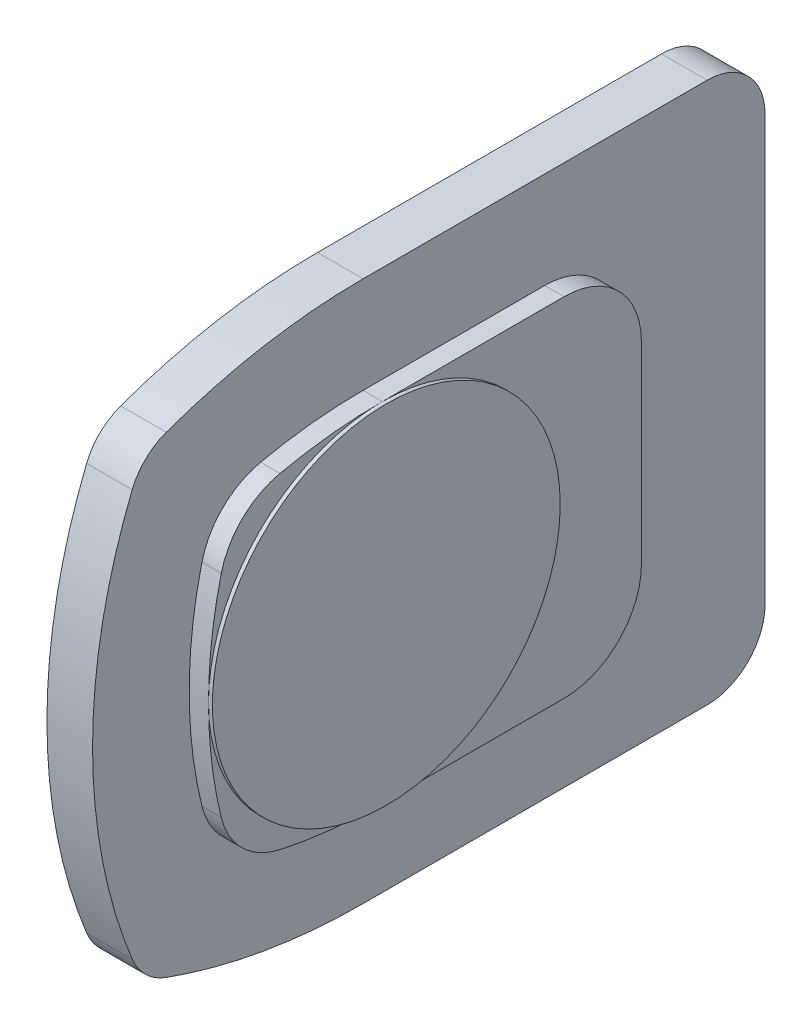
ISO-10303-21;
HEADER;
FILE_DESCRIPTION(('STEP AP214'),'2;1');
FILE_NAME('part.step','',(''),(''),'','','');
FILE_SCHEMA(('AUTOMOTIVE_DESIGN { 1 0 10303 214 1 1 1 1 }'));
ENDSEC;
DATA;
#1=APPLICATION_CONTEXT('core data for automotive mechanical design processes');
#2=APPLICATION_PROTOCOL_DEFINITION('international standard','automotive_design',2000,#1);
#3=PRODUCT_CONTEXT('',#1,'mechanical');
#4=PRODUCT('Part','Part','',(#3));
#5=PRODUCT_RELATED_PRODUCT_CATEGORY('part','',(#4));
#6=PRODUCT_DEFINITION_FORMATION('','',#4);
#7=PRODUCT_DEFINITION_CONTEXT('part definition',#1,'design');
#8=PRODUCT_DEFINITION('design','',#6,#7);
#9=PRODUCT_DEFINITION_SHAPE('','',#8);
#10=(LENGTH_UNIT() NAMED_UNIT(*) SI_UNIT(.MILLI.,.METRE.));
#11=(NAMED_UNIT(*) PLANE_ANGLE_UNIT() SI_UNIT($,.RADIAN.));
#12=(NAMED_UNIT(*) SI_UNIT($,.STERADIAN.) SOLID_ANGLE_UNIT());
#13=UNCERTAINTY_MEASURE_WITH_UNIT(LENGTH_MEASURE(1.E-05),#10,'distance_accuracy_value','');
#14=(GEOMETRIC_REPRESENTATION_CONTEXT(3) GLOBAL_UNCERTAINTY_ASSIGNED_CONTEXT((#13)) GLOBAL_UNIT_ASSIGNED_CONTEXT((#10,
#11,#12)) REPRESENTATION_CONTEXT('',''));
#15=CARTESIAN_POINT('',(0.,0.,0.));
#16=DIRECTION('',(0.,0.,1.));
#17=DIRECTION('',(1.,0.,0.));
#18=AXIS2_PLACEMENT_3D('',#15,#16,#17);
#19=CARTESIAN_POINT('',(156.,1.6493282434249E-12,0.));
#20=DIRECTION('',(1.,0.,0.));
#21=DIRECTION('',(0.,0.,-1.));
#22=AXIS2_PLACEMENT_3D('',#19,#20,#21);
#23=PLANE('',#22);
#24=CARTESIAN_POINT('',(156.,1.6497868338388E-12,0.));
#25=DIRECTION('',(1.,0.,0.));
#26=DIRECTION('',(0.,0.,-1.));
#27=AXIS2_PLACEMENT_3D('',#24,#25,#26);
#28=CIRCLE('',#27,44.9999999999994);
#29=CARTESIAN_POINT('',(156.,1.6497868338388E-12,-44.9999999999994));
#30=VERTEX_POINT('',#29);
#31=EDGE_CURVE('E20',#30,#30,#28,.F.);
#32=ORIENTED_EDGE('',*,*,#31,.F.);
#33=EDGE_LOOP('',(#32));
#34=FACE_BOUND('',#33,.T.);
#35=ADVANCED_FACE('F16',(#34),#23,.T.);
#36=CARTESIAN_POINT('',(155.,1.6497868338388E-12,0.));
#37=DIRECTION('',(1.,0.,0.));
#38=DIRECTION('',(0.,0.,-1.));
#39=AXIS2_PLACEMENT_3D('',#36,#37,#38);
#40=CYLINDRICAL_SURFACE('',#39,44.9999999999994);
#41=CARTESIAN_POINT('',(155.,1.6497868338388E-12,0.));
#42=DIRECTION('',(1.,0.,0.));
#43=DIRECTION('',(0.,0.,-1.));
#44=AXIS2_PLACEMENT_3D('',#41,#42,#43);
#45=CIRCLE('',#44,44.9999999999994);
#46=CARTESIAN_POINT('',(155.,-45.0000000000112,-6.25150972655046E-13));
#47=VERTEX_POINT('',#46);
#48=CARTESIAN_POINT('',(155.,3.6131313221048E-12,44.9999999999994));
#49=VERTEX_POINT('',#48);
#50=EDGE_CURVE('E161',#47,#49,#45,.F.);
#51=ORIENTED_EDGE('',*,*,#50,.F.);
#52=CARTESIAN_POINT('',(155.,1.6497868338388E-12,0.));
#53=DIRECTION('',(1.,0.,0.));
#54=DIRECTION('',(0.,0.,-1.));
#55=AXIS2_PLACEMENT_3D('',#52,#53,#54);
#56=CIRCLE('',#55,44.9999999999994);
#57=CARTESIAN_POINT('',(155.,45.0000000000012,0.));
#58=VERTEX_POINT('',#57);
#59=EDGE_CURVE('E154',#58,#47,#56,.F.);
#60=ORIENTED_EDGE('',*,*,#59,.F.);
#61=CARTESIAN_POINT('',(155.,1.6497868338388E-12,0.));
#62=DIRECTION('',(1.,0.,0.));
#63=DIRECTION('',(0.,0.,-1.));
#64=AXIS2_PLACEMENT_3D('',#61,#62,#63);
#65=CIRCLE('',#64,44.9999999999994);
#66=EDGE_CURVE('E159',#49,#58,#65,.F.);
#67=ORIENTED_EDGE('',*,*,#66,.F.);
#68=EDGE_LOOP('',(#51,#60,#67));
#69=FACE_BOUND('',#68,.T.);
#70=ORIENTED_EDGE('',*,*,#31,.T.);
#71=EDGE_LOOP('',(#70));
#72=FACE_BOUND('',#71,.T.);
#73=ADVANCED_FACE('F156',(#69,#72),#40,.T.);
#74=CARTESIAN_POINT('',(155.,-1.00434261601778E-11,-12.7434198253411));
#75=DIRECTION('',(1.,0.,0.));
#76=DIRECTION('',(0.,0.,-1.));
#77=AXIS2_PLACEMENT_3D('',#74,#75,#76);
#78=PLANE('',#77);
#79=DIRECTION('',(0.,0.,1.));
#80=VECTOR('',#79,1.);
#81=CARTESIAN_POINT('',(155.,45.0000000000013,0.));
#82=LINE('',#81,#80);
#83=CARTESIAN_POINT('',(155.,44.9999999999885,-47.0000000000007));
#84=VERTEX_POINT('',#83);
#85=EDGE_CURVE('E166',#58,#84,#82,.F.);
#86=ORIENTED_EDGE('',*,*,#85,.F.);
#87=ORIENTED_EDGE('',*,*,#59,.T.);
#88=DIRECTION('',(0.,0.,-1.));
#89=VECTOR('',#88,1.);
#90=CARTESIAN_POINT('',(155.,-45.0000000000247,-47.0000000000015));
#91=LINE('',#90,#89);
#92=CARTESIAN_POINT('',(155.,-45.0000000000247,-47.0000000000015));
#93=VERTEX_POINT('',#92);
#94=EDGE_CURVE('E239',#93,#47,#91,.F.);
#95=ORIENTED_EDGE('',*,*,#94,.F.);
#96=CARTESIAN_POINT('',(155.,-25.0000000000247,-47.0000000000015));
#97=DIRECTION('',(1.,0.,0.));
#98=DIRECTION('',(0.,0.,-1.));
#99=AXIS2_PLACEMENT_3D('',#96,#97,#98);
#100=CIRCLE('',#99,20.);
#101=CARTESIAN_POINT('',(155.,-25.0000000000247,-67.0000000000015));
#102=VERTEX_POINT('',#101);
#103=EDGE_CURVE('E217',#102,#93,#100,.F.);
#104=ORIENTED_EDGE('',*,*,#103,.F.);
#105=DIRECTION('',(0.,1.,0.));
#106=VECTOR('',#105,1.);
#107=CARTESIAN_POINT('',(155.,24.9999999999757,-67.0000000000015));
#108=LINE('',#107,#106);
#109=CARTESIAN_POINT('',(155.,24.9999999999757,-67.0000000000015));
#110=VERTEX_POINT('',#109);
#111=EDGE_CURVE('E249',#110,#102,#108,.F.);
#112=ORIENTED_EDGE('',*,*,#111,.F.);
#113=CARTESIAN_POINT('',(155.,24.9999999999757,-47.0000000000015));
#114=DIRECTION('',(1.,0.,0.));
#115=DIRECTION('',(0.,0.,-1.));
#116=AXIS2_PLACEMENT_3D('',#113,#114,#115);
#117=CIRCLE('',#116,20.);
#118=EDGE_CURVE('E169',#84,#110,#117,.F.);
#119=ORIENTED_EDGE('',*,*,#118,.F.);
#120=EDGE_LOOP('',(#86,#87,#95,#104,#112,#119));
#121=FACE_BOUND('',#120,.T.);
#122=ADVANCED_FACE('F167',(#121),#78,.T.);
#123=CARTESIAN_POINT('',(155.,-1.00434261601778E-11,-12.7434198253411));
#124=DIRECTION('',(1.,0.,0.));
#125=DIRECTION('',(0.,0.,-1.));
#126=AXIS2_PLACEMENT_3D('',#123,#124,#125);
#127=PLANE('',#126);
#128=CARTESIAN_POINT('',(155.,-22.6111659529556,22.2699039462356));
#129=DIRECTION('',(1.,0.,0.));
#130=DIRECTION('',(0.,0.,-1.));
#131=AXIS2_PLACEMENT_3D('',#128,#129,#130);
#132=CIRCLE('',#131,20.);
#133=CARTESIAN_POINT('',(155.,-42.156149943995,26.5117904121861));
#134=VERTEX_POINT('',#133);
#135=CARTESIAN_POINT('',(155.,-27.3714114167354,41.6951468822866));
#136=VERTEX_POINT('',#135);
#137=EDGE_CURVE('E211',#134,#136,#132,.F.);
#138=ORIENTED_EDGE('',*,*,#137,.F.);
#139=CARTESIAN_POINT('',(155.,79.9999999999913,-2.9247437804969E-12));
#140=DIRECTION('',(1.,0.,0.));
#141=DIRECTION('',(0.,0.,-1.));
#142=AXIS2_PLACEMENT_3D('',#139,#140,#141);
#143=CIRCLE('',#142,124.99999999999);
#144=EDGE_CURVE('E214',#47,#134,#143,.F.);
#145=ORIENTED_EDGE('',*,*,#144,.F.);
#146=ORIENTED_EDGE('',*,*,#50,.T.);
#147=CARTESIAN_POINT('',(155.,-1.40859546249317E-12,-70.0000000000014));
#148=DIRECTION('',(1.,0.,0.));
#149=DIRECTION('',(0.,0.,-1.));
#150=AXIS2_PLACEMENT_3D('',#147,#148,#149);
#151=CIRCLE('',#150,115.000000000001);
#152=EDGE_CURVE('E208',#136,#49,#151,.F.);
#153=ORIENTED_EDGE('',*,*,#152,.F.);
#154=EDGE_LOOP('',(#138,#145,#146,#153));
#155=FACE_BOUND('',#154,.T.);
#156=ADVANCED_FACE('F227',(#155),#127,.T.);
#157=CARTESIAN_POINT('',(155.,-1.00434261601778E-11,-12.7434198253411));
#158=DIRECTION('',(1.,0.,0.));
#159=DIRECTION('',(0.,0.,-1.));
#160=AXIS2_PLACEMENT_3D('',#157,#158,#159);
#161=PLANE('',#160);
#162=CARTESIAN_POINT('',(155.,22.611165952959,22.2699039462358));
#163=DIRECTION('',(1.,0.,0.));
#164=DIRECTION('',(0.,0.,-1.));
#165=AXIS2_PLACEMENT_3D('',#162,#163,#164);
#166=CIRCLE('',#165,20.);
#167=CARTESIAN_POINT('',(155.,27.3714114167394,41.6951468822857));
#168=VERTEX_POINT('',#167);
#169=CARTESIAN_POINT('',(155.,42.1561499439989,26.5117904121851));
#170=VERTEX_POINT('',#169);
#171=EDGE_CURVE('E199',#168,#170,#166,.F.);
#172=ORIENTED_EDGE('',*,*,#171,.F.);
#173=CARTESIAN_POINT('',(155.,-1.40859546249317E-12,-70.0000000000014));
#174=DIRECTION('',(1.,0.,0.));
#175=DIRECTION('',(0.,0.,-1.));
#176=AXIS2_PLACEMENT_3D('',#173,#174,#175);
#177=CIRCLE('',#176,115.000000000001);
#178=EDGE_CURVE('E183',#49,#168,#177,.F.);
#179=ORIENTED_EDGE('',*,*,#178,.F.);
#180=ORIENTED_EDGE('',*,*,#66,.T.);
#181=CARTESIAN_POINT('',(155.,-80.0000000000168,2.8476545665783E-13));
#182=DIRECTION('',(1.,0.,0.));
#183=DIRECTION('',(0.,0.,-1.));
#184=AXIS2_PLACEMENT_3D('',#181,#182,#183);
#185=CIRCLE('',#184,125.000000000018);
#186=EDGE_CURVE('E181',#170,#58,#185,.F.);
#187=ORIENTED_EDGE('',*,*,#186,.F.);
#188=EDGE_LOOP('',(#172,#179,#180,#187));
#189=FACE_BOUND('',#188,.T.);
#190=ADVANCED_FACE('F179',(#189),#161,.T.);
#191=CARTESIAN_POINT('',(138.2,-1.39649750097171E-12,-18.9338421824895));
#192=DIRECTION('',(1.,0.,0.));
#193=DIRECTION('',(0.,0.,-1.));
#194=AXIS2_PLACEMENT_3D('',#191,#192,#193);
#195=PLANE('',#194);
#196=CARTESIAN_POINT('',(138.2,80.0000000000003,-1.35100264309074E-11));
#197=DIRECTION('',(1.,0.,0.));
#198=DIRECTION('',(0.,0.,-1.));
#199=AXIS2_PLACEMENT_3D('',#196,#197,#198);
#200=CIRCLE('',#199,149.999999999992);
#201=CARTESIAN_POINT('',(138.2,-61.0898114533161,50.9280384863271));
#202=VERTEX_POINT('',#201);
#203=CARTESIAN_POINT('',(138.2,-70.0000000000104,-1.33007754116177E-11));
#204=VERTEX_POINT('',#203);
#205=EDGE_CURVE('E309',#202,#204,#200,.T.);
#206=ORIENTED_EDGE('',*,*,#205,.F.);
#207=CARTESIAN_POINT('',(138.2,-46.9808303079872,45.835234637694));
#208=DIRECTION('',(1.,0.,0.));
#209=DIRECTION('',(0.,0.,-1.));
#210=AXIS2_PLACEMENT_3D('',#207,#208,#209);
#211=CIRCLE('',#210,15.);
#212=CARTESIAN_POINT('',(138.2,-52.6185299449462,59.7354627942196));
#213=VERTEX_POINT('',#212);
#214=EDGE_CURVE('E312',#213,#202,#211,.T.);
#215=ORIENTED_EDGE('',*,*,#214,.F.);
#216=CARTESIAN_POINT('',(138.2,-7.42461647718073E-13,-70.0000000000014));
#217=DIRECTION('',(1.,0.,0.));
#218=DIRECTION('',(0.,0.,-1.));
#219=AXIS2_PLACEMENT_3D('',#216,#217,#218);
#220=CIRCLE('',#219,139.999999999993);
#221=CARTESIAN_POINT('',(138.2,52.6185299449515,59.7354627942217));
#222=VERTEX_POINT('',#221);
#223=EDGE_CURVE('E315',#222,#213,#220,.T.);
#224=ORIENTED_EDGE('',*,*,#223,.F.);
#225=CARTESIAN_POINT('',(138.2,46.9808303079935,45.8352346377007));
#226=DIRECTION('',(1.,0.,0.));
#227=DIRECTION('',(0.,0.,-1.));
#228=AXIS2_PLACEMENT_3D('',#225,#226,#227);
#229=CIRCLE('',#228,15.);
#230=CARTESIAN_POINT('',(138.2,61.0898114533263,50.9280384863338));
#231=VERTEX_POINT('',#230);
#232=EDGE_CURVE('E317',#231,#222,#229,.T.);
#233=ORIENTED_EDGE('',*,*,#232,.F.);
#234=CARTESIAN_POINT('',(138.2,-80.0000000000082,9.08021108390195E-13));
#235=DIRECTION('',(1.,0.,0.));
#236=DIRECTION('',(0.,0.,-1.));
#237=AXIS2_PLACEMENT_3D('',#234,#235,#236);
#238=CIRCLE('',#237,150.00000000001);
#239=CARTESIAN_POINT('',(138.2,70.0000000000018,7.55765702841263E-13));
#240=VERTEX_POINT('',#239);
#241=EDGE_CURVE('E203',#240,#231,#238,.T.);
#242=ORIENTED_EDGE('',*,*,#241,.F.);
#243=DIRECTION('',(0.,0.,1.));
#244=VECTOR('',#243,1.);
#245=CARTESIAN_POINT('',(138.2,70.0000000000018,6.21724893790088E-13));
#246=LINE('',#245,#244);
#247=CARTESIAN_POINT('',(138.2,69.9999999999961,-89.0000000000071));
#248=VERTEX_POINT('',#247);
#249=EDGE_CURVE('E194',#248,#240,#246,.T.);
#250=ORIENTED_EDGE('',*,*,#249,.F.);
#251=CARTESIAN_POINT('',(138.2,54.9999999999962,-89.0000000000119));
#252=DIRECTION('',(1.,0.,0.));
#253=DIRECTION('',(0.,0.,-1.));
#254=AXIS2_PLACEMENT_3D('',#251,#252,#253);
#255=CIRCLE('',#254,14.9999999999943);
#256=CARTESIAN_POINT('',(138.2,55.0000000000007,-104.000000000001));
#257=VERTEX_POINT('',#256);
#258=EDGE_CURVE('E303',#257,#248,#255,.T.);
#259=ORIENTED_EDGE('',*,*,#258,.F.);
#260=DIRECTION('',(0.,1.,0.));
#261=VECTOR('',#260,1.);
#262=CARTESIAN_POINT('',(138.2,55.0000000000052,-103.999999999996));
#263=LINE('',#262,#261);
#264=CARTESIAN_POINT('',(138.2,-55.0000000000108,-103.999999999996));
#265=VERTEX_POINT('',#264);
#266=EDGE_CURVE('E255',#265,#257,#263,.T.);
#267=ORIENTED_EDGE('',*,*,#266,.F.);
#268=CARTESIAN_POINT('',(138.2,-55.000000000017,-89.0000000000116));
#269=DIRECTION('',(1.,0.,0.));
#270=DIRECTION('',(0.,0.,-1.));
#271=AXIS2_PLACEMENT_3D('',#268,#269,#270);
#272=CIRCLE('',#271,14.9999999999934);
#273=CARTESIAN_POINT('',(138.2,-70.0000000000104,-89.0000000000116));
#274=VERTEX_POINT('',#273);
#275=EDGE_CURVE('E307',#274,#265,#272,.T.);
#276=ORIENTED_EDGE('',*,*,#275,.F.);
#277=DIRECTION('',(0.,0.,-1.));
#278=VECTOR('',#277,1.);
#279=CARTESIAN_POINT('',(138.2,-70.0000000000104,-89.0000000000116));
#280=LINE('',#279,#278);
#281=EDGE_CURVE('E258',#204,#274,#280,.T.);
#282=ORIENTED_EDGE('',*,*,#281,.F.);
#283=EDGE_LOOP('',(#206,#215,#224,#233,#242,#250,#259,#267,#276,#282));
#284=FACE_BOUND('',#283,.T.);
#285=ADVANCED_FACE('F367',(#284),#195,.F.);
#286=CARTESIAN_POINT('',(138.2,45.0000000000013,0.));
#287=DIRECTION('',(0.,1.,0.));
#288=DIRECTION('',(0.,0.,1.));
#289=AXIS2_PLACEMENT_3D('',#286,#287,#288);
#290=PLANE('',#289);
#291=ORIENTED_EDGE('',*,*,#85,.T.);
#292=DIRECTION('',(1.,0.,0.));
#293=VECTOR('',#292,1.);
#294=CARTESIAN_POINT('',(138.2,44.9999999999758,-46.9999999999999));
#295=LINE('',#294,#293);
#296=CARTESIAN_POINT('',(150.,44.9999999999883,-47.0000000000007));
#297=VERTEX_POINT('',#296);
#298=EDGE_CURVE('E173',#297,#84,#295,.T.);
#299=ORIENTED_EDGE('',*,*,#298,.F.);
#300=DIRECTION('',(0.,0.,-1.));
#301=VECTOR('',#300,1.);
#302=CARTESIAN_POINT('',(150.,45.0000000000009,-18.9338421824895));
#303=LINE('',#302,#301);
#304=CARTESIAN_POINT('',(150.,45.0000000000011,1.16383560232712E-13));
#305=VERTEX_POINT('',#304);
#306=EDGE_CURVE('E190',#305,#297,#303,.T.);
#307=ORIENTED_EDGE('',*,*,#306,.F.);
#308=DIRECTION('',(1.,0.,0.));
#309=VECTOR('',#308,1.);
#310=CARTESIAN_POINT('',(138.2,45.0000000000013,0.));
#311=LINE('',#310,#309);
#312=EDGE_CURVE('E187',#58,#305,#311,.F.);
#313=ORIENTED_EDGE('',*,*,#312,.F.);
#314=EDGE_LOOP('',(#291,#299,#307,#313));
#315=FACE_BOUND('',#314,.T.);
#316=ADVANCED_FACE('F188',(#315),#290,.T.);
#317=CARTESIAN_POINT('',(150.,24.9999999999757,-47.0000000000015));
#318=DIRECTION('',(1.,0.,0.));
#319=DIRECTION('',(0.,0.,-1.));
#320=AXIS2_PLACEMENT_3D('',#317,#318,#319);
#321=CYLINDRICAL_SURFACE('',#320,20.);
#322=ORIENTED_EDGE('',*,*,#118,.T.);
#323=DIRECTION('',(1.,0.,0.));
#324=VECTOR('',#323,1.);
#325=CARTESIAN_POINT('',(138.2,24.9999999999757,-67.0000000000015));
#326=LINE('',#325,#324);
#327=CARTESIAN_POINT('',(150.,24.9999999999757,-67.0000000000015));
#328=VERTEX_POINT('',#327);
#329=EDGE_CURVE('E221',#328,#110,#326,.T.);
#330=ORIENTED_EDGE('',*,*,#329,.F.);
#331=CARTESIAN_POINT('',(150.,24.9999999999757,-47.0000000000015));
#332=DIRECTION('',(1.,0.,0.));
#333=DIRECTION('',(0.,0.,-1.));
#334=AXIS2_PLACEMENT_3D('',#331,#332,#333);
#335=CIRCLE('',#334,20.);
#336=EDGE_CURVE('E300',#297,#328,#335,.F.);
#337=ORIENTED_EDGE('',*,*,#336,.F.);
#338=ORIENTED_EDGE('',*,*,#298,.T.);
#339=EDGE_LOOP('',(#322,#330,#337,#338));
#340=FACE_BOUND('',#339,.T.);
#341=ADVANCED_FACE('F450',(#340),#321,.T.);
#342=CARTESIAN_POINT('',(138.2,24.9999999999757,-67.0000000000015));
#343=DIRECTION('',(0.,0.,-1.));
#344=DIRECTION('',(0.,1.,0.));
#345=AXIS2_PLACEMENT_3D('',#342,#343,#344);
#346=PLANE('',#345);
#347=ORIENTED_EDGE('',*,*,#111,.T.);
#348=DIRECTION('',(1.,0.,0.));
#349=VECTOR('',#348,1.);
#350=CARTESIAN_POINT('',(138.2,-25.0000000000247,-67.0000000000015));
#351=LINE('',#350,#349);
#352=CARTESIAN_POINT('',(150.,-25.0000000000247,-67.0000000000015));
#353=VERTEX_POINT('',#352);
#354=EDGE_CURVE('E220',#353,#102,#351,.T.);
#355=ORIENTED_EDGE('',*,*,#354,.F.);
#356=DIRECTION('',(0.,1.,0.));
#357=VECTOR('',#356,1.);
#358=CARTESIAN_POINT('',(150.,-1.39327785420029E-12,-67.0000000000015));
#359=LINE('',#358,#357);
#360=EDGE_CURVE('E299',#328,#353,#359,.F.);
#361=ORIENTED_EDGE('',*,*,#360,.F.);
#362=ORIENTED_EDGE('',*,*,#329,.T.);
#363=EDGE_LOOP('',(#347,#355,#361,#362));
#364=FACE_BOUND('',#363,.T.);
#365=ADVANCED_FACE('F445',(#364),#346,.T.);
#366=CARTESIAN_POINT('',(150.,-25.0000000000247,-47.0000000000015));
#367=DIRECTION('',(1.,0.,0.));
#368=DIRECTION('',(0.,0.,-1.));
#369=AXIS2_PLACEMENT_3D('',#366,#367,#368);
#370=CYLINDRICAL_SURFACE('',#369,20.);
#371=ORIENTED_EDGE('',*,*,#103,.T.);
#372=DIRECTION('',(1.,0.,0.));
#373=VECTOR('',#372,1.);
#374=CARTESIAN_POINT('',(138.2,-45.0000000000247,-47.0000000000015));
#375=LINE('',#374,#373);
#376=CARTESIAN_POINT('',(150.,-45.0000000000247,-47.0000000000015));
#377=VERTEX_POINT('',#376);
#378=EDGE_CURVE('E219',#377,#93,#375,.T.);
#379=ORIENTED_EDGE('',*,*,#378,.F.);
#380=CARTESIAN_POINT('',(150.,-25.0000000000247,-47.0000000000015));
#381=DIRECTION('',(1.,0.,0.));
#382=DIRECTION('',(0.,0.,-1.));
#383=AXIS2_PLACEMENT_3D('',#380,#381,#382);
#384=CIRCLE('',#383,20.);
#385=EDGE_CURVE('E296',#353,#377,#384,.F.);
#386=ORIENTED_EDGE('',*,*,#385,.F.);
#387=ORIENTED_EDGE('',*,*,#354,.T.);
#388=EDGE_LOOP('',(#371,#379,#386,#387));
#389=FACE_BOUND('',#388,.T.);
#390=ADVANCED_FACE('F441',(#389),#370,.T.);
#391=CARTESIAN_POINT('',(138.2,-45.0000000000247,-47.0000000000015));
#392=DIRECTION('',(0.,-1.,0.));
#393=DIRECTION('',(0.,0.,-1.));
#394=AXIS2_PLACEMENT_3D('',#391,#392,#393);
#395=PLANE('',#394);
#396=ORIENTED_EDGE('',*,*,#94,.T.);
#397=DIRECTION('',(1.,0.,0.));
#398=VECTOR('',#397,1.);
#399=CARTESIAN_POINT('',(138.2,-44.9999999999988,0.));
#400=LINE('',#399,#398);
#401=CARTESIAN_POINT('',(150.,-45.0000000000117,-1.45407297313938E-12));
#402=VERTEX_POINT('',#401);
#403=EDGE_CURVE('E216',#402,#47,#400,.T.);
#404=ORIENTED_EDGE('',*,*,#403,.F.);
#405=DIRECTION('',(0.,0.,-1.));
#406=VECTOR('',#405,1.);
#407=CARTESIAN_POINT('',(150.,-45.0000000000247,-18.9338421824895));
#408=LINE('',#407,#406);
#409=EDGE_CURVE('E295',#377,#402,#408,.F.);
#410=ORIENTED_EDGE('',*,*,#409,.F.);
#411=ORIENTED_EDGE('',*,*,#378,.T.);
#412=EDGE_LOOP('',(#396,#404,#410,#411));
#413=FACE_BOUND('',#412,.T.);
#414=ADVANCED_FACE('F437',(#413),#395,.T.);
#415=CARTESIAN_POINT('',(150.,79.9999999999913,-2.9247437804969E-12));
#416=DIRECTION('',(1.,0.,0.));
#417=DIRECTION('',(0.,0.,-1.));
#418=AXIS2_PLACEMENT_3D('',#415,#416,#417);
#419=CYLINDRICAL_SURFACE('',#418,124.99999999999);
#420=ORIENTED_EDGE('',*,*,#144,.T.);
#421=DIRECTION('',(1.,0.,0.));
#422=VECTOR('',#421,1.);
#423=CARTESIAN_POINT('',(138.2,-42.1561499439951,26.511790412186));
#424=LINE('',#423,#422);
#425=CARTESIAN_POINT('',(150.,-42.156149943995,26.5117904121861));
#426=VERTEX_POINT('',#425);
#427=EDGE_CURVE('E213',#426,#134,#424,.T.);
#428=ORIENTED_EDGE('',*,*,#427,.F.);
#429=CARTESIAN_POINT('',(150.,79.9999999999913,-2.9247437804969E-12));
#430=DIRECTION('',(1.,0.,0.));
#431=DIRECTION('',(0.,0.,-1.));
#432=AXIS2_PLACEMENT_3D('',#429,#430,#431);
#433=CIRCLE('',#432,124.99999999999);
#434=EDGE_CURVE('E235',#402,#426,#433,.F.);
#435=ORIENTED_EDGE('',*,*,#434,.F.);
#436=ORIENTED_EDGE('',*,*,#403,.T.);
#437=EDGE_LOOP('',(#420,#428,#435,#436));
#438=FACE_BOUND('',#437,.T.);
#439=ADVANCED_FACE('F233',(#438),#419,.T.);
#440=CARTESIAN_POINT('',(150.,-22.6111659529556,22.2699039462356));
#441=DIRECTION('',(1.,0.,0.));
#442=DIRECTION('',(0.,0.,-1.));
#443=AXIS2_PLACEMENT_3D('',#440,#441,#442);
#444=CYLINDRICAL_SURFACE('',#443,20.);
#445=ORIENTED_EDGE('',*,*,#137,.T.);
#446=DIRECTION('',(1.,0.,0.));
#447=VECTOR('',#446,1.);
#448=CARTESIAN_POINT('',(138.2,-27.3714114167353,41.6951468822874));
#449=LINE('',#448,#447);
#450=CARTESIAN_POINT('',(150.,-27.3714114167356,41.6951468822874));
#451=VERTEX_POINT('',#450);
#452=EDGE_CURVE('E210',#451,#136,#449,.T.);
#453=ORIENTED_EDGE('',*,*,#452,.F.);
#454=CARTESIAN_POINT('',(150.,-22.6111659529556,22.2699039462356));
#455=DIRECTION('',(1.,0.,0.));
#456=DIRECTION('',(0.,0.,-1.));
#457=AXIS2_PLACEMENT_3D('',#454,#455,#456);
#458=CIRCLE('',#457,20.);
#459=EDGE_CURVE('E291',#426,#451,#458,.F.);
#460=ORIENTED_EDGE('',*,*,#459,.F.);
#461=ORIENTED_EDGE('',*,*,#427,.T.);
#462=EDGE_LOOP('',(#445,#453,#460,#461));
#463=FACE_BOUND('',#462,.T.);
#464=ADVANCED_FACE('F337',(#463),#444,.T.);
#465=CARTESIAN_POINT('',(150.,-1.40859546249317E-12,-70.0000000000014));
#466=DIRECTION('',(1.,0.,0.));
#467=DIRECTION('',(0.,0.,-1.));
#468=AXIS2_PLACEMENT_3D('',#465,#466,#467);
#469=CYLINDRICAL_SURFACE('',#468,115.000000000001);
#470=ORIENTED_EDGE('',*,*,#178,.T.);
#471=DIRECTION('',(1.,0.,0.));
#472=VECTOR('',#471,1.);
#473=CARTESIAN_POINT('',(138.2,27.3714114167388,41.6951468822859));
#474=LINE('',#473,#472);
#475=CARTESIAN_POINT('',(150.,27.3714114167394,41.6951468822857));
#476=VERTEX_POINT('',#475);
#477=EDGE_CURVE('E206',#476,#168,#474,.T.);
#478=ORIENTED_EDGE('',*,*,#477,.F.);
#479=CARTESIAN_POINT('',(150.,-1.40859546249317E-12,-70.0000000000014));
#480=DIRECTION('',(1.,0.,0.));
#481=DIRECTION('',(0.,0.,-1.));
#482=AXIS2_PLACEMENT_3D('',#479,#480,#481);
#483=CIRCLE('',#482,115.000000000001);
#484=EDGE_CURVE('E288',#451,#476,#483,.F.);
#485=ORIENTED_EDGE('',*,*,#484,.F.);
#486=ORIENTED_EDGE('',*,*,#452,.T.);
#487=ORIENTED_EDGE('',*,*,#152,.T.);
#488=EDGE_LOOP('',(#470,#478,#485,#486,#487));
#489=FACE_BOUND('',#488,.T.);
#490=ADVANCED_FACE('F334',(#489),#469,.T.);
#491=CARTESIAN_POINT('',(150.,22.611165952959,22.2699039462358));
#492=DIRECTION('',(1.,0.,0.));
#493=DIRECTION('',(0.,0.,-1.));
#494=AXIS2_PLACEMENT_3D('',#491,#492,#493);
#495=CYLINDRICAL_SURFACE('',#494,20.);
#496=ORIENTED_EDGE('',*,*,#171,.T.);
#497=DIRECTION('',(1.,0.,0.));
#498=VECTOR('',#497,1.);
#499=CARTESIAN_POINT('',(138.2,42.156149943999,26.5117904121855));
#500=LINE('',#499,#498);
#501=CARTESIAN_POINT('',(150.,42.1561499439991,26.5117904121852));
#502=VERTEX_POINT('',#501);
#503=EDGE_CURVE('E197',#502,#170,#500,.T.);
#504=ORIENTED_EDGE('',*,*,#503,.F.);
#505=CARTESIAN_POINT('',(150.,22.611165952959,22.2699039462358));
#506=DIRECTION('',(1.,0.,0.));
#507=DIRECTION('',(0.,0.,-1.));
#508=AXIS2_PLACEMENT_3D('',#505,#506,#507);
#509=CIRCLE('',#508,20.);
#510=EDGE_CURVE('E285',#476,#502,#509,.F.);
#511=ORIENTED_EDGE('',*,*,#510,.F.);
#512=ORIENTED_EDGE('',*,*,#477,.T.);
#513=EDGE_LOOP('',(#496,#504,#511,#512));
#514=FACE_BOUND('',#513,.T.);
#515=ADVANCED_FACE('F423',(#514),#495,.T.);
#516=CARTESIAN_POINT('',(150.,-80.0000000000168,2.8476545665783E-13));
#517=DIRECTION('',(1.,0.,0.));
#518=DIRECTION('',(0.,0.,-1.));
#519=AXIS2_PLACEMENT_3D('',#516,#517,#518);
#520=CYLINDRICAL_SURFACE('',#519,125.000000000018);
#521=ORIENTED_EDGE('',*,*,#186,.T.);
#522=ORIENTED_EDGE('',*,*,#312,.T.);
#523=CARTESIAN_POINT('',(150.,-80.0000000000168,2.8476545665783E-13));
#524=DIRECTION('',(1.,0.,0.));
#525=DIRECTION('',(0.,0.,-1.));
#526=AXIS2_PLACEMENT_3D('',#523,#524,#525);
#527=CIRCLE('',#526,125.000000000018);
#528=EDGE_CURVE('E283',#502,#305,#527,.F.);
#529=ORIENTED_EDGE('',*,*,#528,.F.);
#530=ORIENTED_EDGE('',*,*,#503,.T.);
#531=EDGE_LOOP('',(#521,#522,#529,#530));
#532=FACE_BOUND('',#531,.T.);
#533=ADVANCED_FACE('F196',(#532),#520,.T.);
#534=CARTESIAN_POINT('',(138.2,70.0000000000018,6.21724893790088E-13));
#535=DIRECTION('',(0.,1.,0.));
#536=DIRECTION('',(0.,0.,1.));
#537=AXIS2_PLACEMENT_3D('',#534,#535,#536);
#538=PLANE('',#537);
#539=ORIENTED_EDGE('',*,*,#249,.T.);
#540=DIRECTION('',(1.,0.,0.));
#541=VECTOR('',#540,1.);
#542=CARTESIAN_POINT('',(138.2,70.0000000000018,6.12617595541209E-13));
#543=LINE('',#542,#541);
#544=CARTESIAN_POINT('',(150.,70.0000000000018,7.60319351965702E-13));
#545=VERTEX_POINT('',#544);
#546=EDGE_CURVE('E254',#545,#240,#543,.F.);
#547=ORIENTED_EDGE('',*,*,#546,.F.);
#548=DIRECTION('',(0.,0.,-1.));
#549=VECTOR('',#548,1.);
#550=CARTESIAN_POINT('',(150.,70.0000000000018,-18.9338421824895));
#551=LINE('',#550,#549);
#552=CARTESIAN_POINT('',(150.,69.9999999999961,-89.0000000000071));
#553=VERTEX_POINT('',#552);
#554=EDGE_CURVE('E282',#553,#545,#551,.F.);
#555=ORIENTED_EDGE('',*,*,#554,.F.);
#556=DIRECTION('',(1.,0.,0.));
#557=VECTOR('',#556,1.);
#558=CARTESIAN_POINT('',(138.2,69.9999999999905,-89.0000000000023));
#559=LINE('',#558,#557);
#560=EDGE_CURVE('E306',#248,#553,#559,.T.);
#561=ORIENTED_EDGE('',*,*,#560,.F.);
#562=EDGE_LOOP('',(#539,#547,#555,#561));
#563=FACE_BOUND('',#562,.T.);
#564=ADVANCED_FACE('F388',(#563),#538,.T.);
#565=CARTESIAN_POINT('',(138.2,-80.0000000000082,9.08021108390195E-13));
#566=DIRECTION('',(1.,0.,0.));
#567=DIRECTION('',(0.,0.,-1.));
#568=AXIS2_PLACEMENT_3D('',#565,#566,#567);
#569=CYLINDRICAL_SURFACE('',#568,150.00000000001);
#570=ORIENTED_EDGE('',*,*,#241,.T.);
#571=DIRECTION('',(1.,0.,0.));
#572=VECTOR('',#571,1.);
#573=CARTESIAN_POINT('',(138.2,61.089811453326,50.9280384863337));
#574=LINE('',#573,#572);
#575=CARTESIAN_POINT('',(150.,61.089811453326,50.9280384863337));
#576=VERTEX_POINT('',#575);
#577=EDGE_CURVE('E318',#576,#231,#574,.F.);
#578=ORIENTED_EDGE('',*,*,#577,.F.);
#579=CARTESIAN_POINT('',(150.,-80.0000000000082,9.08021108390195E-13));
#580=DIRECTION('',(1.,0.,0.));
#581=DIRECTION('',(0.,0.,-1.));
#582=AXIS2_PLACEMENT_3D('',#579,#580,#581);
#583=CIRCLE('',#582,150.00000000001);
#584=EDGE_CURVE('E279',#545,#576,#583,.T.);
#585=ORIENTED_EDGE('',*,*,#584,.F.);
#586=ORIENTED_EDGE('',*,*,#546,.T.);
#587=EDGE_LOOP('',(#570,#578,#585,#586));
#588=FACE_BOUND('',#587,.T.);
#589=ADVANCED_FACE('F381',(#588),#569,.T.);
#590=CARTESIAN_POINT('',(138.2,46.9808303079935,45.8352346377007));
#591=DIRECTION('',(1.,0.,0.));
#592=DIRECTION('',(0.,0.,-1.));
#593=AXIS2_PLACEMENT_3D('',#590,#591,#592);
#594=CYLINDRICAL_SURFACE('',#593,15.);
#595=ORIENTED_EDGE('',*,*,#232,.T.);
#596=DIRECTION('',(1.,0.,0.));
#597=VECTOR('',#596,1.);
#598=CARTESIAN_POINT('',(138.2,52.6185299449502,59.7354627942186));
#599=LINE('',#598,#597);
#600=CARTESIAN_POINT('',(150.,52.6185299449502,59.7354627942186));
#601=VERTEX_POINT('',#600);
#602=EDGE_CURVE('E316',#601,#222,#599,.F.);
#603=ORIENTED_EDGE('',*,*,#602,.F.);
#604=CARTESIAN_POINT('',(150.,46.9808303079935,45.8352346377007));
#605=DIRECTION('',(1.,0.,0.));
#606=DIRECTION('',(0.,0.,-1.));
#607=AXIS2_PLACEMENT_3D('',#604,#605,#606);
#608=CIRCLE('',#607,15.);
#609=EDGE_CURVE('E276',#576,#601,#608,.T.);
#610=ORIENTED_EDGE('',*,*,#609,.F.);
#611=ORIENTED_EDGE('',*,*,#577,.T.);
#612=EDGE_LOOP('',(#595,#603,#610,#611));
#613=FACE_BOUND('',#612,.T.);
#614=ADVANCED_FACE('F379',(#613),#594,.T.);
#615=CARTESIAN_POINT('',(138.2,-7.42461647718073E-13,-70.0000000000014));
#616=DIRECTION('',(1.,0.,0.));
#617=DIRECTION('',(0.,0.,-1.));
#618=AXIS2_PLACEMENT_3D('',#615,#616,#617);
#619=CYLINDRICAL_SURFACE('',#618,139.999999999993);
#620=ORIENTED_EDGE('',*,*,#223,.T.);
#621=DIRECTION('',(1.,0.,0.));
#622=VECTOR('',#621,1.);
#623=CARTESIAN_POINT('',(138.2,-52.6185299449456,59.7354627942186));
#624=LINE('',#623,#622);
#625=CARTESIAN_POINT('',(150.,-52.6185299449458,59.7354627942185));
#626=VERTEX_POINT('',#625);
#627=EDGE_CURVE('E314',#626,#213,#624,.F.);
#628=ORIENTED_EDGE('',*,*,#627,.F.);
#629=CARTESIAN_POINT('',(150.,-7.42461647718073E-13,-70.0000000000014));
#630=DIRECTION('',(1.,0.,0.));
#631=DIRECTION('',(0.,0.,-1.));
#632=AXIS2_PLACEMENT_3D('',#629,#630,#631);
#633=CIRCLE('',#632,139.999999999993);
#634=EDGE_CURVE('E273',#601,#626,#633,.T.);
#635=ORIENTED_EDGE('',*,*,#634,.F.);
#636=ORIENTED_EDGE('',*,*,#602,.T.);
#637=EDGE_LOOP('',(#620,#628,#635,#636));
#638=FACE_BOUND('',#637,.T.);
#639=ADVANCED_FACE('F365',(#638),#619,.T.);
#640=CARTESIAN_POINT('',(138.2,-46.9808303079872,45.835234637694));
#641=DIRECTION('',(1.,0.,0.));
#642=DIRECTION('',(0.,0.,-1.));
#643=AXIS2_PLACEMENT_3D('',#640,#641,#642);
#644=CYLINDRICAL_SURFACE('',#643,15.);
#645=ORIENTED_EDGE('',*,*,#214,.T.);
#646=DIRECTION('',(1.,0.,0.));
#647=VECTOR('',#646,1.);
#648=CARTESIAN_POINT('',(138.2,-61.0898114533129,50.928038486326));
#649=LINE('',#648,#647);
#650=CARTESIAN_POINT('',(150.,-61.0898114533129,50.928038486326));
#651=VERTEX_POINT('',#650);
#652=EDGE_CURVE('E311',#651,#202,#649,.F.);
#653=ORIENTED_EDGE('',*,*,#652,.F.);
#654=CARTESIAN_POINT('',(150.,-46.9808303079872,45.835234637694));
#655=DIRECTION('',(1.,0.,0.));
#656=DIRECTION('',(0.,0.,-1.));
#657=AXIS2_PLACEMENT_3D('',#654,#655,#656);
#658=CIRCLE('',#657,15.);
#659=EDGE_CURVE('E270',#626,#651,#658,.T.);
#660=ORIENTED_EDGE('',*,*,#659,.F.);
#661=ORIENTED_EDGE('',*,*,#627,.T.);
#662=EDGE_LOOP('',(#645,#653,#660,#661));
#663=FACE_BOUND('',#662,.T.);
#664=ADVANCED_FACE('F360',(#663),#644,.T.);
#665=CARTESIAN_POINT('',(138.2,80.0000000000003,-1.35100264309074E-11));
#666=DIRECTION('',(1.,0.,0.));
#667=DIRECTION('',(0.,0.,-1.));
#668=AXIS2_PLACEMENT_3D('',#665,#666,#667);
#669=CYLINDRICAL_SURFACE('',#668,149.999999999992);
#670=ORIENTED_EDGE('',*,*,#205,.T.);
#671=DIRECTION('',(1.,0.,0.));
#672=VECTOR('',#671,1.);
#673=CARTESIAN_POINT('',(138.2,-70.0000000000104,-1.31006316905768E-11));
#674=LINE('',#673,#672);
#675=CARTESIAN_POINT('',(150.,-70.000000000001,-1.33053290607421E-11));
#676=VERTEX_POINT('',#675);
#677=EDGE_CURVE('E260',#676,#204,#674,.F.);
#678=ORIENTED_EDGE('',*,*,#677,.F.);
#679=CARTESIAN_POINT('',(150.,80.0000000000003,-1.35100264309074E-11));
#680=DIRECTION('',(1.,0.,0.));
#681=DIRECTION('',(0.,0.,-1.));
#682=AXIS2_PLACEMENT_3D('',#679,#680,#681);
#683=CIRCLE('',#682,149.999999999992);
#684=EDGE_CURVE('E267',#651,#676,#683,.T.);
#685=ORIENTED_EDGE('',*,*,#684,.F.);
#686=ORIENTED_EDGE('',*,*,#652,.T.);
#687=EDGE_LOOP('',(#670,#678,#685,#686));
#688=FACE_BOUND('',#687,.T.);
#689=ADVANCED_FACE('F372',(#688),#669,.T.);
#690=CARTESIAN_POINT('',(138.2,-70.0000000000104,-89.0000000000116));
#691=DIRECTION('',(0.,-1.,0.));
#692=DIRECTION('',(0.,0.,-1.));
#693=AXIS2_PLACEMENT_3D('',#690,#691,#692);
#694=PLANE('',#693);
#695=ORIENTED_EDGE('',*,*,#281,.T.);
#696=DIRECTION('',(1.,0.,0.));
#697=VECTOR('',#696,1.);
#698=CARTESIAN_POINT('',(138.2,-70.0000000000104,-89.0000000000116));
#699=LINE('',#698,#697);
#700=CARTESIAN_POINT('',(150.,-70.000000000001,-89.0000000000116));
#701=VERTEX_POINT('',#700);
#702=EDGE_CURVE('E259',#701,#274,#699,.F.);
#703=ORIENTED_EDGE('',*,*,#702,.F.);
#704=DIRECTION('',(0.,0.,-1.));
#705=VECTOR('',#704,1.);
#706=CARTESIAN_POINT('',(150.,-69.9999999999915,-18.9338421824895));
#707=LINE('',#706,#705);
#708=EDGE_CURVE('E266',#676,#701,#707,.T.);
#709=ORIENTED_EDGE('',*,*,#708,.F.);
#710=ORIENTED_EDGE('',*,*,#677,.T.);
#711=EDGE_LOOP('',(#695,#703,#709,#710));
#712=FACE_BOUND('',#711,.T.);
#713=ADVANCED_FACE('F404',(#712),#694,.T.);
#714=CARTESIAN_POINT('',(138.2,-55.000000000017,-89.0000000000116));
#715=DIRECTION('',(1.,0.,0.));
#716=DIRECTION('',(0.,0.,-1.));
#717=AXIS2_PLACEMENT_3D('',#714,#715,#716);
#718=CYLINDRICAL_SURFACE('',#717,14.9999999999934);
#719=ORIENTED_EDGE('',*,*,#275,.T.);
#720=DIRECTION('',(1.,0.,0.));
#721=VECTOR('',#720,1.);
#722=CARTESIAN_POINT('',(138.2,-55.0000000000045,-103.999999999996));
#723=LINE('',#722,#721);
#724=CARTESIAN_POINT('',(150.,-55.0000000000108,-103.999999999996));
#725=VERTEX_POINT('',#724);
#726=EDGE_CURVE('E257',#725,#265,#723,.F.);
#727=ORIENTED_EDGE('',*,*,#726,.F.);
#728=CARTESIAN_POINT('',(150.,-55.000000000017,-89.0000000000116));
#729=DIRECTION('',(1.,0.,0.));
#730=DIRECTION('',(0.,0.,-1.));
#731=AXIS2_PLACEMENT_3D('',#728,#729,#730);
#732=CIRCLE('',#731,14.9999999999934);
#733=EDGE_CURVE('E263',#701,#725,#732,.T.);
#734=ORIENTED_EDGE('',*,*,#733,.F.);
#735=ORIENTED_EDGE('',*,*,#702,.T.);
#736=EDGE_LOOP('',(#719,#727,#734,#735));
#737=FACE_BOUND('',#736,.T.);
#738=ADVANCED_FACE('F399',(#737),#718,.T.);
#739=CARTESIAN_POINT('',(138.2,55.0000000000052,-103.999999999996));
#740=DIRECTION('',(0.,0.,-1.));
#741=DIRECTION('',(0.,1.,0.));
#742=AXIS2_PLACEMENT_3D('',#739,#740,#741);
#743=PLANE('',#742);
#744=ORIENTED_EDGE('',*,*,#266,.T.);
#745=DIRECTION('',(1.,0.,0.));
#746=VECTOR('',#745,1.);
#747=CARTESIAN_POINT('',(138.2,55.0000000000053,-104.000000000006));
#748=LINE('',#747,#746);
#749=CARTESIAN_POINT('',(150.,55.0000000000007,-104.000000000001));
#750=VERTEX_POINT('',#749);
#751=EDGE_CURVE('E35',#750,#257,#748,.F.);
#752=ORIENTED_EDGE('',*,*,#751,.F.);
#753=DIRECTION('',(0.,1.,0.));
#754=VECTOR('',#753,1.);
#755=CARTESIAN_POINT('',(150.,-1.39327785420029E-12,-103.999999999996));
#756=LINE('',#755,#754);
#757=EDGE_CURVE('E26',#725,#750,#756,.T.);
#758=ORIENTED_EDGE('',*,*,#757,.F.);
#759=ORIENTED_EDGE('',*,*,#726,.T.);
#760=EDGE_LOOP('',(#744,#752,#758,#759));
#761=FACE_BOUND('',#760,.T.);
#762=ADVANCED_FACE('F395',(#761),#743,.T.);
#763=CARTESIAN_POINT('',(138.2,54.9999999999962,-89.0000000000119));
#764=DIRECTION('',(1.,0.,0.));
#765=DIRECTION('',(0.,0.,-1.));
#766=AXIS2_PLACEMENT_3D('',#763,#764,#765);
#767=CYLINDRICAL_SURFACE('',#766,14.9999999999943);
#768=ORIENTED_EDGE('',*,*,#258,.T.);
#769=ORIENTED_EDGE('',*,*,#560,.T.);
#770=CARTESIAN_POINT('',(150.,54.9999999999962,-89.0000000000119));
#771=DIRECTION('',(1.,0.,0.));
#772=DIRECTION('',(0.,0.,-1.));
#773=AXIS2_PLACEMENT_3D('',#770,#771,#772);
#774=CIRCLE('',#773,14.9999999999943);
#775=EDGE_CURVE('E10',#750,#553,#774,.T.);
#776=ORIENTED_EDGE('',*,*,#775,.F.);
#777=ORIENTED_EDGE('',*,*,#751,.T.);
#778=EDGE_LOOP('',(#768,#769,#776,#777));
#779=FACE_BOUND('',#778,.T.);
#780=ADVANCED_FACE('F392',(#779),#767,.T.);
#781=CARTESIAN_POINT('',(150.,-1.39327785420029E-12,-18.9338421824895));
#782=DIRECTION('',(1.,0.,0.));
#783=DIRECTION('',(0.,0.,-1.));
#784=AXIS2_PLACEMENT_3D('',#781,#782,#783);
#785=PLANE('',#784);
#786=ORIENTED_EDGE('',*,*,#757,.T.);
#787=ORIENTED_EDGE('',*,*,#775,.T.);
#788=ORIENTED_EDGE('',*,*,#554,.T.);
#789=ORIENTED_EDGE('',*,*,#584,.T.);
#790=ORIENTED_EDGE('',*,*,#609,.T.);
#791=ORIENTED_EDGE('',*,*,#634,.T.);
#792=ORIENTED_EDGE('',*,*,#659,.T.);
#793=ORIENTED_EDGE('',*,*,#684,.T.);
#794=ORIENTED_EDGE('',*,*,#708,.T.);
#795=ORIENTED_EDGE('',*,*,#733,.T.);
#796=EDGE_LOOP('',(#786,#787,#788,#789,#790,#791,#792,#793,#794,#795));
#797=FACE_BOUND('',#796,.T.);
#798=ORIENTED_EDGE('',*,*,#510,.T.);
#799=ORIENTED_EDGE('',*,*,#528,.T.);
#800=ORIENTED_EDGE('',*,*,#306,.T.);
#801=ORIENTED_EDGE('',*,*,#336,.T.);
#802=ORIENTED_EDGE('',*,*,#360,.T.);
#803=ORIENTED_EDGE('',*,*,#385,.T.);
#804=ORIENTED_EDGE('',*,*,#409,.T.);
#805=ORIENTED_EDGE('',*,*,#434,.T.);
#806=ORIENTED_EDGE('',*,*,#459,.T.);
#807=ORIENTED_EDGE('',*,*,#484,.T.);
#808=EDGE_LOOP('',(#798,#799,#800,#801,#802,#803,#804,#805,#806,#807));
#809=FACE_BOUND('',#808,.T.);
#810=ADVANCED_FACE('F18',(#797,#809),#785,.T.);
#811=CLOSED_SHELL('',(#35,#73,#122,#156,#190,#285,#316,#341,#365,#390,#414,#439,#464,#490,#515,
#533,#564,#589,#614,#639,#664,#689,#713,#738,#762,#780,#810));
#812=MANIFOLD_SOLID_BREP('B1',#811);
#813=ADVANCED_BREP_SHAPE_REPRESENTATION('',(#18,#812),#14);
#814=SHAPE_DEFINITION_REPRESENTATION(#9,#813);
ENDSEC;
END-ISO-10303-21;
